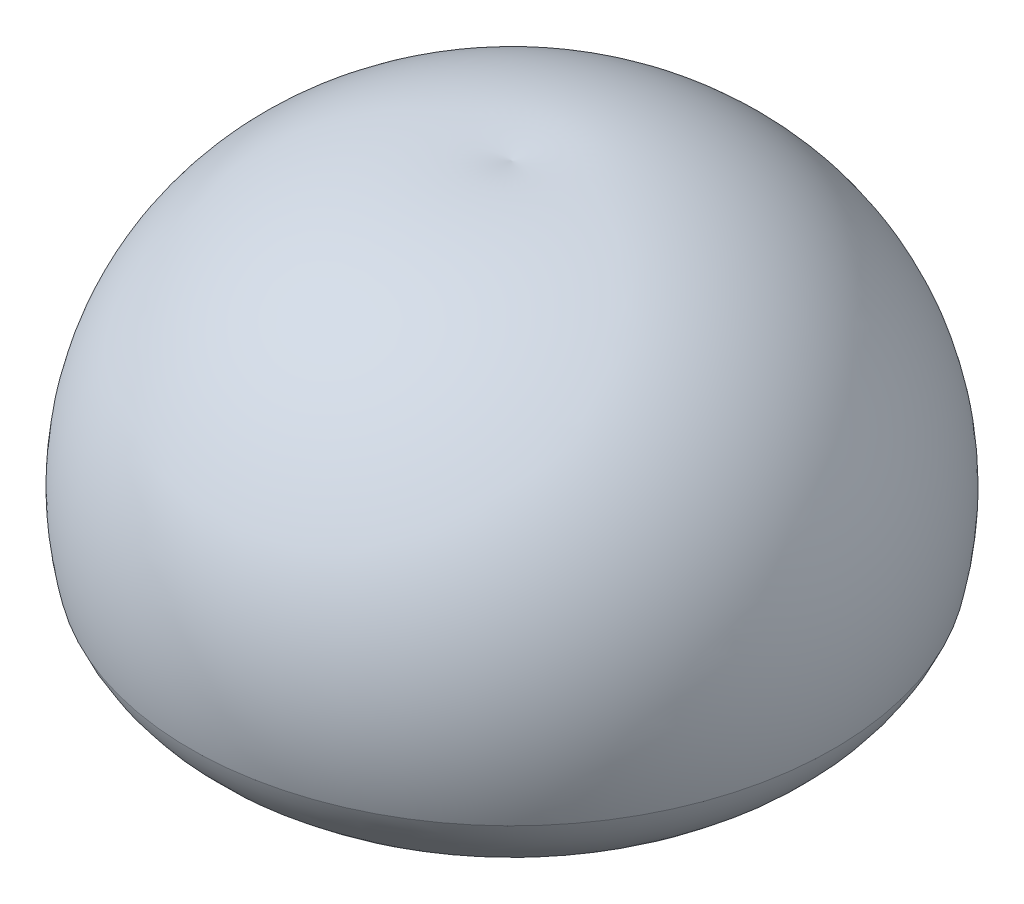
ISO-10303-21;
HEADER;
FILE_DESCRIPTION(('STEP AP214'),'2;1');
FILE_NAME('part.step','',(''),(''),'','','');
FILE_SCHEMA(('AUTOMOTIVE_DESIGN { 1 0 10303 214 1 1 1 1 }'));
ENDSEC;
DATA;
#1=APPLICATION_CONTEXT('core data for automotive mechanical design processes');
#2=APPLICATION_PROTOCOL_DEFINITION('international standard','automotive_design',2000,#1);
#3=PRODUCT_CONTEXT('',#1,'mechanical');
#4=PRODUCT('Part','Part','',(#3));
#5=PRODUCT_RELATED_PRODUCT_CATEGORY('part','',(#4));
#6=PRODUCT_DEFINITION_FORMATION('','',#4);
#7=PRODUCT_DEFINITION_CONTEXT('part definition',#1,'design');
#8=PRODUCT_DEFINITION('design','',#6,#7);
#9=PRODUCT_DEFINITION_SHAPE('','',#8);
#10=(LENGTH_UNIT() NAMED_UNIT(*) SI_UNIT(.MILLI.,.METRE.));
#11=(NAMED_UNIT(*) PLANE_ANGLE_UNIT() SI_UNIT($,.RADIAN.));
#12=(NAMED_UNIT(*) SI_UNIT($,.STERADIAN.) SOLID_ANGLE_UNIT());
#13=UNCERTAINTY_MEASURE_WITH_UNIT(LENGTH_MEASURE(1.E-05),#10,'distance_accuracy_value','');
#14=(GEOMETRIC_REPRESENTATION_CONTEXT(3) GLOBAL_UNCERTAINTY_ASSIGNED_CONTEXT((#13)) GLOBAL_UNIT_ASSIGNED_CONTEXT((#10,
#11,#12)) REPRESENTATION_CONTEXT('',''));
#15=CARTESIAN_POINT('',(0.,0.,0.));
#16=DIRECTION('',(0.,0.,1.));
#17=DIRECTION('',(1.,0.,0.));
#18=AXIS2_PLACEMENT_3D('',#15,#16,#17);
#19=CARTESIAN_POINT('',(0.,1130.23009231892,770.47395849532));
#20=DIRECTION('',(-1.,0.,0.));
#21=DIRECTION('',(0.,0.,-1.));
#22=AXIS2_PLACEMENT_3D('',#19,#20,#21);
#23=CIRCLE('',#22,1132.92762346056);
#24=TRIMMED_CURVE('',#23,(PARAMETER_VALUE(-0.822933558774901)),
(PARAMETER_VALUE(0.822933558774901)),.T.,.PARAMETER.);
#25=CARTESIAN_POINT('',(0.,1130.23009231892,0.));
#26=DIRECTION('',(0.,-1.,0.));
#27=AXIS1_PLACEMENT('',#25,#26);
#28=SURFACE_OF_REVOLUTION('',#24,#27);
#29=CARTESIAN_POINT('',(0.,1960.82920096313,0.));
#30=VERTEX_POINT('',#29);
#31=VERTEX_LOOP('',#30);
#32=FACE_BOUND('',#31,.T.);
#33=CARTESIAN_POINT('',(0.,1456.70200837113,0.));
#34=DIRECTION('',(0.,-1.,0.));
#35=DIRECTION('',(0.,0.,-1.));
#36=AXIS2_PLACEMENT_3D('',#33,#34,#35);
#37=CIRCLE('',#36,314.395198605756);
#38=CARTESIAN_POINT('',(0.,1456.70200837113,-314.395198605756));
#39=VERTEX_POINT('',#38);
#40=EDGE_CURVE('E34',#39,#39,#37,.T.);
#41=ORIENTED_EDGE('',*,*,#40,.T.);
#42=EDGE_LOOP('',(#41));
#43=FACE_BOUND('',#42,.T.);
#44=ADVANCED_FACE('F16',(#32,#43),#28,.F.);
#45=CARTESIAN_POINT('',(0.,830.,-350.));
#46=DIRECTION('',(-1.,0.,0.));
#47=DIRECTION('',(0.,0.,-1.));
#48=AXIS2_PLACEMENT_3D('',#45,#46,#47);
#49=CIRCLE('',#48,2266.99530770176);
#50=TRIMMED_CURVE('',#49,(PARAMETER_VALUE(-1.7258057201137)),(PARAMETER_VALUE(1.7258057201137)),
.T.,.PARAMETER.);
#51=CARTESIAN_POINT('',(0.,830.,0.));
#52=DIRECTION('',(0.,-1.,0.));
#53=AXIS1_PLACEMENT('',#51,#52);
#54=SURFACE_OF_REVOLUTION('',#50,#53);
#55=CARTESIAN_POINT('',(0.,299.885387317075,0.));
#56=DIRECTION('',(0.,-1.,0.));
#57=DIRECTION('',(0.,0.,-1.));
#58=AXIS2_PLACEMENT_3D('',#55,#56,#57);
#59=CIRCLE('',#58,2554.14296781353);
#60=CARTESIAN_POINT('',(0.,299.885387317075,-2554.14296781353));
#61=VERTEX_POINT('',#60);
#62=EDGE_CURVE('E10',#61,#61,#59,.T.);
#63=ORIENTED_EDGE('',*,*,#62,.F.);
#64=EDGE_LOOP('',(#63));
#65=FACE_BOUND('',#64,.T.);
#66=CARTESIAN_POINT('',(0.,3069.81421665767,0.));
#67=VERTEX_POINT('',#66);
#68=VERTEX_LOOP('',#67);
#69=FACE_BOUND('',#68,.T.);
#70=ADVANCED_FACE('F31',(#65,#69),#54,.T.);
#71=CARTESIAN_POINT('',(0.,728.899338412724,0.));
#72=DIRECTION('',(0.,-1.,0.));
#73=DIRECTION('',(0.,0.,-1.));
#74=AXIS2_PLACEMENT_3D('',#71,#72,#73);
#75=TOROIDAL_SURFACE('',#74,1505.58584978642,1132.92762346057);
#76=CARTESIAN_POINT('',(0.,219.001712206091,0.));
#77=DIRECTION('',(0.,-1.,0.));
#78=DIRECTION('',(0.,0.,-1.));
#79=AXIS2_PLACEMENT_3D('',#76,#77,#78);
#80=CIRCLE('',#79,493.889546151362);
#81=CARTESIAN_POINT('',(0.,219.001712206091,-493.889546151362));
#82=VERTEX_POINT('',#81);
#83=EDGE_CURVE('E23',#82,#82,#80,.T.);
#84=ORIENTED_EDGE('',*,*,#83,.F.);
#85=EDGE_LOOP('',(#84));
#86=FACE_BOUND('',#85,.T.);
#87=ORIENTED_EDGE('',*,*,#62,.T.);
#88=EDGE_LOOP('',(#87));
#89=FACE_BOUND('',#88,.T.);
#90=ADVANCED_FACE('F42',(#86,#89),#75,.T.);
#91=CARTESIAN_POINT('',(0.,830.,0.));
#92=DIRECTION('',(0.,-1.,0.));
#93=DIRECTION('',(0.,0.,-1.));
#94=AXIS2_PLACEMENT_3D('',#91,#92,#93);
#95=DEGENERATE_TOROIDAL_SURFACE('',#94,350.,627.712600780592,.T.);
#96=ORIENTED_EDGE('',*,*,#40,.F.);
#97=EDGE_LOOP('',(#96));
#98=FACE_BOUND('',#97,.T.);
#99=ORIENTED_EDGE('',*,*,#83,.T.);
#100=EDGE_LOOP('',(#99));
#101=FACE_BOUND('',#100,.T.);
#102=ADVANCED_FACE('F40',(#98,#101),#95,.F.);
#103=CLOSED_SHELL('',(#44,#70,#90,#102));
#104=MANIFOLD_SOLID_BREP('B1',#103);
#105=ADVANCED_BREP_SHAPE_REPRESENTATION('',(#18,#104),#14);
#106=SHAPE_DEFINITION_REPRESENTATION(#9,#105);
ENDSEC;
END-ISO-10303-21;
